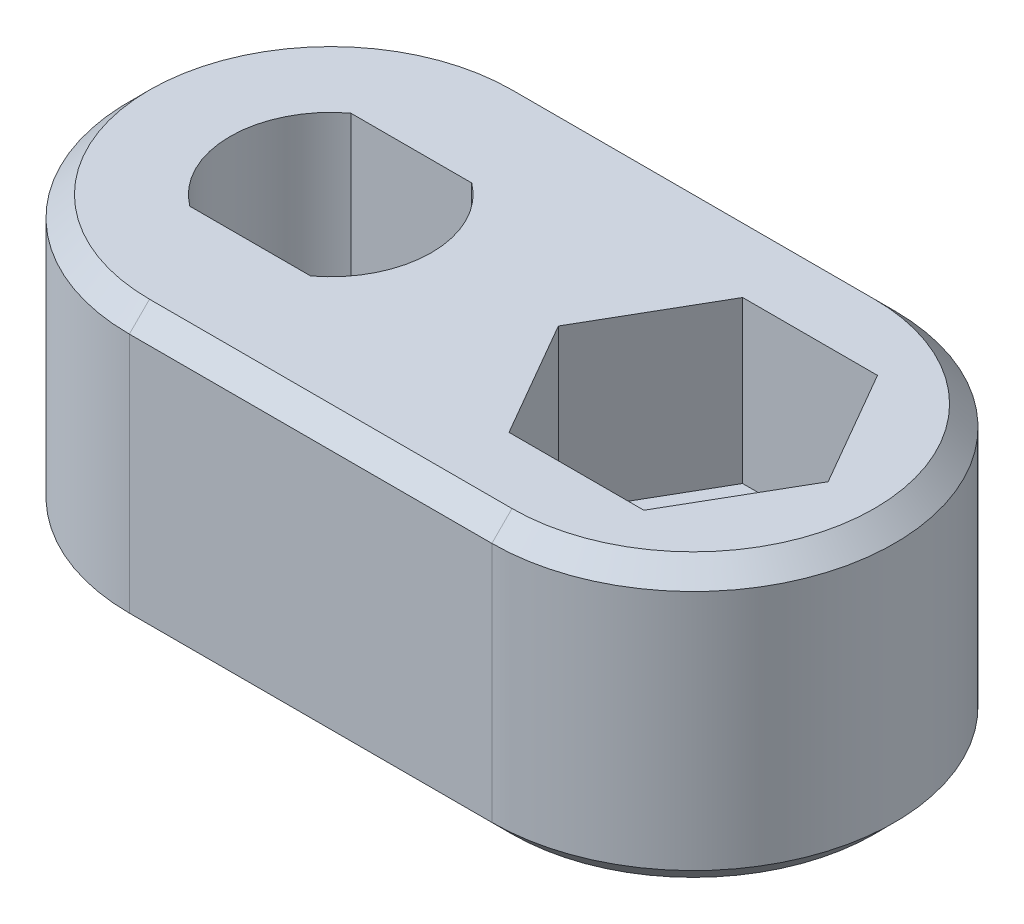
ISO-10303-21;
HEADER;
FILE_DESCRIPTION(('STEP AP214'),'2;1');
FILE_NAME('part.step','',(''),(''),'','','');
FILE_SCHEMA(('AUTOMOTIVE_DESIGN { 1 0 10303 214 1 1 1 1 }'));
ENDSEC;
DATA;
#1=APPLICATION_CONTEXT('core data for automotive mechanical design processes');
#2=APPLICATION_PROTOCOL_DEFINITION('international standard','automotive_design',2000,#1);
#3=PRODUCT_CONTEXT('',#1,'mechanical');
#4=PRODUCT('Part','Part','',(#3));
#5=PRODUCT_RELATED_PRODUCT_CATEGORY('part','',(#4));
#6=PRODUCT_DEFINITION_FORMATION('','',#4);
#7=PRODUCT_DEFINITION_CONTEXT('part definition',#1,'design');
#8=PRODUCT_DEFINITION('design','',#6,#7);
#9=PRODUCT_DEFINITION_SHAPE('','',#8);
#10=(LENGTH_UNIT() NAMED_UNIT(*) SI_UNIT(.MILLI.,.METRE.));
#11=(NAMED_UNIT(*) PLANE_ANGLE_UNIT() SI_UNIT($,.RADIAN.));
#12=(NAMED_UNIT(*) SI_UNIT($,.STERADIAN.) SOLID_ANGLE_UNIT());
#13=UNCERTAINTY_MEASURE_WITH_UNIT(LENGTH_MEASURE(1.E-05),#10,'distance_accuracy_value','');
#14=(GEOMETRIC_REPRESENTATION_CONTEXT(3) GLOBAL_UNCERTAINTY_ASSIGNED_CONTEXT((#13)) GLOBAL_UNIT_ASSIGNED_CONTEXT((#10,
#11,#12)) REPRESENTATION_CONTEXT('',''));
#15=CARTESIAN_POINT('',(0.,0.,0.));
#16=DIRECTION('',(0.,0.,1.));
#17=DIRECTION('',(1.,0.,0.));
#18=AXIS2_PLACEMENT_3D('',#15,#16,#17);
#19=CARTESIAN_POINT('',(9.,0.,0.));
#20=DIRECTION('',(0.,-1.,0.));
#21=DIRECTION('',(0.,0.,-1.));
#22=AXIS2_PLACEMENT_3D('',#19,#20,#21);
#23=CYLINDRICAL_SURFACE('',#22,2.07500000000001);
#24=CARTESIAN_POINT('',(9.,0.,0.));
#25=DIRECTION('',(0.,-1.,0.));
#26=DIRECTION('',(0.,0.,-1.));
#27=AXIS2_PLACEMENT_3D('',#24,#25,#26);
#28=CIRCLE('',#27,2.07500000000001);
#29=CARTESIAN_POINT('',(9.,0.,-2.07500000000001));
#30=VERTEX_POINT('',#29);
#31=EDGE_CURVE('E236',#30,#30,#28,.T.);
#32=ORIENTED_EDGE('',*,*,#31,.T.);
#33=EDGE_LOOP('',(#32));
#34=FACE_BOUND('',#33,.T.);
#35=CARTESIAN_POINT('',(9.,3.,0.));
#36=DIRECTION('',(0.,1.,0.));
#37=DIRECTION('',(0.,0.,1.));
#38=AXIS2_PLACEMENT_3D('',#35,#36,#37);
#39=CIRCLE('',#38,2.07500000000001);
#40=CARTESIAN_POINT('',(9.,3.,2.07500000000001));
#41=VERTEX_POINT('',#40);
#42=EDGE_CURVE('E228',#41,#41,#39,.F.);
#43=ORIENTED_EDGE('',*,*,#42,.F.);
#44=EDGE_LOOP('',(#43));
#45=FACE_BOUND('',#44,.T.);
#46=ADVANCED_FACE('F48',(#34,#45),#23,.F.);
#47=CARTESIAN_POINT('',(0.,7.,0.));
#48=DIRECTION('',(0.,-1.,0.));
#49=DIRECTION('',(0.,0.,-1.));
#50=AXIS2_PLACEMENT_3D('',#47,#48,#49);
#51=CYLINDRICAL_SURFACE('',#50,5.);
#52=DIRECTION('',(0.,-1.,0.));
#53=VECTOR('',#52,1.);
#54=CARTESIAN_POINT('',(0.,7.,5.));
#55=LINE('',#54,#53);
#56=CARTESIAN_POINT('',(0.,6.5,5.));
#57=VERTEX_POINT('',#56);
#58=CARTESIAN_POINT('',(0.,0.500000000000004,5.));
#59=VERTEX_POINT('',#58);
#60=EDGE_CURVE('E282',#57,#59,#55,.T.);
#61=ORIENTED_EDGE('',*,*,#60,.F.);
#62=CARTESIAN_POINT('',(0.,6.5,0.));
#63=DIRECTION('',(0.,1.,0.));
#64=DIRECTION('',(0.,0.,1.));
#65=AXIS2_PLACEMENT_3D('',#62,#63,#64);
#66=CIRCLE('',#65,5.);
#67=CARTESIAN_POINT('',(0.,6.5,-5.));
#68=VERTEX_POINT('',#67);
#69=EDGE_CURVE('E306',#57,#68,#66,.F.);
#70=ORIENTED_EDGE('',*,*,#69,.T.);
#71=DIRECTION('',(0.,-1.,0.));
#72=VECTOR('',#71,1.);
#73=CARTESIAN_POINT('',(0.,7.,-5.));
#74=LINE('',#73,#72);
#75=CARTESIAN_POINT('',(0.,0.500000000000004,-5.));
#76=VERTEX_POINT('',#75);
#77=EDGE_CURVE('E267',#68,#76,#74,.T.);
#78=ORIENTED_EDGE('',*,*,#77,.T.);
#79=CARTESIAN_POINT('',(0.,0.500000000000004,0.));
#80=DIRECTION('',(0.,1.,0.));
#81=DIRECTION('',(0.,0.,1.));
#82=AXIS2_PLACEMENT_3D('',#79,#80,#81);
#83=CIRCLE('',#82,5.);
#84=EDGE_CURVE('E304',#76,#59,#83,.T.);
#85=ORIENTED_EDGE('',*,*,#84,.T.);
#86=EDGE_LOOP('',(#61,#70,#78,#85));
#87=FACE_BOUND('',#86,.T.);
#88=ADVANCED_FACE('F357',(#87),#51,.T.);
#89=CARTESIAN_POINT('',(0.,7.,5.));
#90=DIRECTION('',(0.,0.,-1.));
#91=DIRECTION('',(-1.,0.,0.));
#92=AXIS2_PLACEMENT_3D('',#89,#90,#91);
#93=PLANE('',#92);
#94=DIRECTION('',(0.,-1.,0.));
#95=VECTOR('',#94,1.);
#96=CARTESIAN_POINT('',(9.,7.,5.));
#97=LINE('',#96,#95);
#98=CARTESIAN_POINT('',(9.,6.5,5.));
#99=VERTEX_POINT('',#98);
#100=CARTESIAN_POINT('',(9.,0.500000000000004,5.));
#101=VERTEX_POINT('',#100);
#102=EDGE_CURVE('E279',#99,#101,#97,.T.);
#103=ORIENTED_EDGE('',*,*,#102,.F.);
#104=DIRECTION('',(-1.,0.,0.));
#105=VECTOR('',#104,1.);
#106=CARTESIAN_POINT('',(0.,6.5,5.));
#107=LINE('',#106,#105);
#108=EDGE_CURVE('E314',#99,#57,#107,.T.);
#109=ORIENTED_EDGE('',*,*,#108,.T.);
#110=ORIENTED_EDGE('',*,*,#60,.T.);
#111=DIRECTION('',(1.,0.,0.));
#112=VECTOR('',#111,1.);
#113=CARTESIAN_POINT('',(0.,0.500000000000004,5.));
#114=LINE('',#113,#112);
#115=EDGE_CURVE('E312',#59,#101,#114,.T.);
#116=ORIENTED_EDGE('',*,*,#115,.T.);
#117=EDGE_LOOP('',(#103,#109,#110,#116));
#118=FACE_BOUND('',#117,.T.);
#119=ADVANCED_FACE('F374',(#118),#93,.F.);
#120=CARTESIAN_POINT('',(9.,7.,0.));
#121=DIRECTION('',(0.,-1.,0.));
#122=DIRECTION('',(0.,0.,-1.));
#123=AXIS2_PLACEMENT_3D('',#120,#121,#122);
#124=CYLINDRICAL_SURFACE('',#123,5.);
#125=DIRECTION('',(0.,-1.,0.));
#126=VECTOR('',#125,1.);
#127=CARTESIAN_POINT('',(9.,7.,-5.));
#128=LINE('',#127,#126);
#129=CARTESIAN_POINT('',(9.,6.5,-5.));
#130=VERTEX_POINT('',#129);
#131=CARTESIAN_POINT('',(9.,0.500000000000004,-5.));
#132=VERTEX_POINT('',#131);
#133=EDGE_CURVE('E276',#130,#132,#128,.T.);
#134=ORIENTED_EDGE('',*,*,#133,.F.);
#135=CARTESIAN_POINT('',(9.,6.5,0.));
#136=DIRECTION('',(0.,1.,0.));
#137=DIRECTION('',(0.,0.,1.));
#138=AXIS2_PLACEMENT_3D('',#135,#136,#137);
#139=CIRCLE('',#138,5.);
#140=EDGE_CURVE('E310',#130,#99,#139,.F.);
#141=ORIENTED_EDGE('',*,*,#140,.T.);
#142=ORIENTED_EDGE('',*,*,#102,.T.);
#143=CARTESIAN_POINT('',(9.,0.500000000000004,0.));
#144=DIRECTION('',(0.,1.,0.));
#145=DIRECTION('',(0.,0.,1.));
#146=AXIS2_PLACEMENT_3D('',#143,#144,#145);
#147=CIRCLE('',#146,5.);
#148=EDGE_CURVE('E308',#101,#132,#147,.T.);
#149=ORIENTED_EDGE('',*,*,#148,.T.);
#150=EDGE_LOOP('',(#134,#141,#142,#149));
#151=FACE_BOUND('',#150,.T.);
#152=ADVANCED_FACE('F370',(#151),#124,.T.);
#153=CARTESIAN_POINT('',(0.,7.,-5.));
#154=DIRECTION('',(0.,0.,1.));
#155=DIRECTION('',(1.,0.,0.));
#156=AXIS2_PLACEMENT_3D('',#153,#154,#155);
#157=PLANE('',#156);
#158=ORIENTED_EDGE('',*,*,#77,.F.);
#159=DIRECTION('',(1.,0.,0.));
#160=VECTOR('',#159,1.);
#161=CARTESIAN_POINT('',(9.,6.5,-5.));
#162=LINE('',#161,#160);
#163=EDGE_CURVE('E301',#68,#130,#162,.T.);
#164=ORIENTED_EDGE('',*,*,#163,.T.);
#165=ORIENTED_EDGE('',*,*,#133,.T.);
#166=DIRECTION('',(-1.,0.,0.));
#167=VECTOR('',#166,1.);
#168=CARTESIAN_POINT('',(0.,0.500000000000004,-5.));
#169=LINE('',#168,#167);
#170=EDGE_CURVE('E298',#132,#76,#169,.T.);
#171=ORIENTED_EDGE('',*,*,#170,.T.);
#172=EDGE_LOOP('',(#158,#164,#165,#171));
#173=FACE_BOUND('',#172,.T.);
#174=ADVANCED_FACE('F354',(#173),#157,.F.);
#175=CARTESIAN_POINT('',(0.,7.,0.));
#176=DIRECTION('',(0.,1.,0.));
#177=DIRECTION('',(0.,0.,1.));
#178=AXIS2_PLACEMENT_3D('',#175,#176,#177);
#179=PLANE('',#178);
#180=CARTESIAN_POINT('',(9.,7.,0.));
#181=DIRECTION('',(0.,1.,0.));
#182=DIRECTION('',(0.,0.,1.));
#183=AXIS2_PLACEMENT_3D('',#180,#181,#182);
#184=CIRCLE('',#183,4.5);
#185=CARTESIAN_POINT('',(9.,7.,4.5));
#186=VERTEX_POINT('',#185);
#187=CARTESIAN_POINT('',(9.,7.,-4.5));
#188=VERTEX_POINT('',#187);
#189=EDGE_CURVE('E291',#186,#188,#184,.T.);
#190=ORIENTED_EDGE('',*,*,#189,.T.);
#191=DIRECTION('',(-1.,0.,0.));
#192=VECTOR('',#191,1.);
#193=CARTESIAN_POINT('',(0.,7.,-4.5));
#194=LINE('',#193,#192);
#195=CARTESIAN_POINT('',(0.,7.,-4.5));
#196=VERTEX_POINT('',#195);
#197=EDGE_CURVE('E295',#188,#196,#194,.T.);
#198=ORIENTED_EDGE('',*,*,#197,.T.);
#199=CARTESIAN_POINT('',(0.,7.,0.));
#200=DIRECTION('',(0.,1.,0.));
#201=DIRECTION('',(0.,0.,1.));
#202=AXIS2_PLACEMENT_3D('',#199,#200,#201);
#203=CIRCLE('',#202,4.5);
#204=CARTESIAN_POINT('',(0.,7.,4.5));
#205=VERTEX_POINT('',#204);
#206=EDGE_CURVE('E293',#196,#205,#203,.T.);
#207=ORIENTED_EDGE('',*,*,#206,.T.);
#208=DIRECTION('',(1.,0.,0.));
#209=VECTOR('',#208,1.);
#210=CARTESIAN_POINT('',(9.,7.,4.5));
#211=LINE('',#210,#209);
#212=EDGE_CURVE('E285',#205,#186,#211,.T.);
#213=ORIENTED_EDGE('',*,*,#212,.T.);
#214=EDGE_LOOP('',(#190,#198,#207,#213));
#215=FACE_BOUND('',#214,.T.);
#216=DIRECTION('',(0.5,0.,-0.866025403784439));
#217=VECTOR('',#216,1.);
#218=CARTESIAN_POINT('',(10.6743157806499,7.,2.89999999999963));
#219=LINE('',#218,#217);
#220=CARTESIAN_POINT('',(10.6743157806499,7.,2.89999999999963));
#221=VERTEX_POINT('',#220);
#222=CARTESIAN_POINT('',(12.3486315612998,7.,-3.65159291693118E-13));
#223=VERTEX_POINT('',#222);
#224=EDGE_CURVE('E182',#221,#223,#219,.T.);
#225=ORIENTED_EDGE('',*,*,#224,.F.);
#226=DIRECTION('',(1.,0.,0.));
#227=VECTOR('',#226,1.);
#228=CARTESIAN_POINT('',(7.32568421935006,7.,2.89999999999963));
#229=LINE('',#228,#227);
#230=CARTESIAN_POINT('',(7.32568421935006,7.,2.89999999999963));
#231=VERTEX_POINT('',#230);
#232=EDGE_CURVE('E201',#231,#221,#229,.T.);
#233=ORIENTED_EDGE('',*,*,#232,.F.);
#234=DIRECTION('',(0.5,0.,0.866025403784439));
#235=VECTOR('',#234,1.);
#236=CARTESIAN_POINT('',(5.65136843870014,7.,-3.6457803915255E-13));
#237=LINE('',#236,#235);
#238=CARTESIAN_POINT('',(5.65136843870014,7.,-3.6457803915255E-13));
#239=VERTEX_POINT('',#238);
#240=EDGE_CURVE('E204',#239,#231,#237,.T.);
#241=ORIENTED_EDGE('',*,*,#240,.F.);
#242=DIRECTION('',(-0.5,0.,0.866025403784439));
#243=VECTOR('',#242,1.);
#244=CARTESIAN_POINT('',(7.32568421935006,7.,-2.90000000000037));
#245=LINE('',#244,#243);
#246=CARTESIAN_POINT('',(7.32568421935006,7.,-2.90000000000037));
#247=VERTEX_POINT('',#246);
#248=EDGE_CURVE('E221',#247,#239,#245,.T.);
#249=ORIENTED_EDGE('',*,*,#248,.F.);
#250=DIRECTION('',(-1.,0.,0.));
#251=VECTOR('',#250,1.);
#252=CARTESIAN_POINT('',(10.6743157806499,7.,-2.90000000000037));
#253=LINE('',#252,#251);
#254=CARTESIAN_POINT('',(10.6743157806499,7.,-2.90000000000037));
#255=VERTEX_POINT('',#254);
#256=EDGE_CURVE('E218',#255,#247,#253,.T.);
#257=ORIENTED_EDGE('',*,*,#256,.F.);
#258=DIRECTION('',(-0.5,0.,-0.866025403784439));
#259=VECTOR('',#258,1.);
#260=CARTESIAN_POINT('',(12.3486315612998,7.,-3.65159291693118E-13));
#261=LINE('',#260,#259);
#262=EDGE_CURVE('E215',#223,#255,#261,.T.);
#263=ORIENTED_EDGE('',*,*,#262,.F.);
#264=EDGE_LOOP('',(#225,#233,#241,#249,#257,#263));
#265=FACE_BOUND('',#264,.T.);
#266=CARTESIAN_POINT('',(0.,7.,0.));
#267=DIRECTION('',(0.,1.,0.));
#268=DIRECTION('',(0.,0.,1.));
#269=AXIS2_PLACEMENT_3D('',#266,#267,#268);
#270=CIRCLE('',#269,2.5);
#271=CARTESIAN_POINT('',(1.5,7.,2.));
#272=VERTEX_POINT('',#271);
#273=CARTESIAN_POINT('',(1.5,7.,-2.));
#274=VERTEX_POINT('',#273);
#275=EDGE_CURVE('E257',#272,#274,#270,.T.);
#276=ORIENTED_EDGE('',*,*,#275,.F.);
#277=DIRECTION('',(1.,0.,0.));
#278=VECTOR('',#277,1.);
#279=CARTESIAN_POINT('',(0.,7.,2.));
#280=LINE('',#279,#278);
#281=CARTESIAN_POINT('',(-1.5,7.,2.));
#282=VERTEX_POINT('',#281);
#283=EDGE_CURVE('E250',#282,#272,#280,.T.);
#284=ORIENTED_EDGE('',*,*,#283,.F.);
#285=CARTESIAN_POINT('',(-1.5,7.,-2.));
#286=VERTEX_POINT('',#285);
#287=EDGE_CURVE('E260',#286,#282,#270,.T.);
#288=ORIENTED_EDGE('',*,*,#287,.F.);
#289=DIRECTION('',(1.,0.,0.));
#290=VECTOR('',#289,1.);
#291=CARTESIAN_POINT('',(0.,7.,-2.));
#292=LINE('',#291,#290);
#293=EDGE_CURVE('E259',#286,#274,#292,.T.);
#294=ORIENTED_EDGE('',*,*,#293,.T.);
#295=EDGE_LOOP('',(#276,#284,#288,#294));
#296=FACE_BOUND('',#295,.T.);
#297=ADVANCED_FACE('F383',(#215,#265,#296),#179,.T.);
#298=CARTESIAN_POINT('',(0.,0.,0.));
#299=DIRECTION('',(0.,1.,0.));
#300=DIRECTION('',(0.,0.,1.));
#301=AXIS2_PLACEMENT_3D('',#298,#299,#300);
#302=PLANE('',#301);
#303=CARTESIAN_POINT('',(0.,0.,0.));
#304=DIRECTION('',(0.,1.,0.));
#305=DIRECTION('',(0.,0.,1.));
#306=AXIS2_PLACEMENT_3D('',#303,#304,#305);
#307=CIRCLE('',#306,4.5);
#308=CARTESIAN_POINT('',(0.,0.,4.5));
#309=VERTEX_POINT('',#308);
#310=CARTESIAN_POINT('',(0.,0.,-4.5));
#311=VERTEX_POINT('',#310);
#312=EDGE_CURVE('E57',#309,#311,#307,.F.);
#313=ORIENTED_EDGE('',*,*,#312,.T.);
#314=DIRECTION('',(1.,0.,0.));
#315=VECTOR('',#314,1.);
#316=CARTESIAN_POINT('',(0.,0.,-4.5));
#317=LINE('',#316,#315);
#318=CARTESIAN_POINT('',(9.,0.,-4.5));
#319=VERTEX_POINT('',#318);
#320=EDGE_CURVE('E13',#311,#319,#317,.T.);
#321=ORIENTED_EDGE('',*,*,#320,.T.);
#322=CARTESIAN_POINT('',(9.,0.,0.));
#323=DIRECTION('',(0.,1.,0.));
#324=DIRECTION('',(0.,0.,1.));
#325=AXIS2_PLACEMENT_3D('',#322,#323,#324);
#326=CIRCLE('',#325,4.5);
#327=CARTESIAN_POINT('',(9.,0.,4.5));
#328=VERTEX_POINT('',#327);
#329=EDGE_CURVE('E318',#319,#328,#326,.F.);
#330=ORIENTED_EDGE('',*,*,#329,.T.);
#331=DIRECTION('',(-1.,0.,0.));
#332=VECTOR('',#331,1.);
#333=CARTESIAN_POINT('',(0.,0.,4.5));
#334=LINE('',#333,#332);
#335=EDGE_CURVE('E316',#328,#309,#334,.T.);
#336=ORIENTED_EDGE('',*,*,#335,.T.);
#337=EDGE_LOOP('',(#313,#321,#330,#336));
#338=FACE_BOUND('',#337,.T.);
#339=ORIENTED_EDGE('',*,*,#31,.F.);
#340=EDGE_LOOP('',(#339));
#341=FACE_BOUND('',#340,.T.);
#342=CARTESIAN_POINT('',(0.,0.,0.));
#343=DIRECTION('',(0.,-1.,0.));
#344=DIRECTION('',(0.,0.,-1.));
#345=AXIS2_PLACEMENT_3D('',#342,#343,#344);
#346=CIRCLE('',#345,3.36);
#347=CARTESIAN_POINT('',(0.,0.,-3.36));
#348=VERTEX_POINT('',#347);
#349=EDGE_CURVE('E239',#348,#348,#346,.T.);
#350=ORIENTED_EDGE('',*,*,#349,.F.);
#351=EDGE_LOOP('',(#350));
#352=FACE_BOUND('',#351,.T.);
#353=ADVANCED_FACE('F345',(#338,#341,#352),#302,.F.);
#354=CARTESIAN_POINT('',(0.,3.,0.));
#355=DIRECTION('',(0.,1.,0.));
#356=DIRECTION('',(0.,0.,1.));
#357=AXIS2_PLACEMENT_3D('',#354,#355,#356);
#358=CYLINDRICAL_SURFACE('',#357,2.5);
#359=ORIENTED_EDGE('',*,*,#275,.T.);
#360=DIRECTION('',(0.,1.,0.));
#361=VECTOR('',#360,1.);
#362=CARTESIAN_POINT('',(1.5,3.,-2.));
#363=LINE('',#362,#361);
#364=CARTESIAN_POINT('',(1.5,3.,-2.));
#365=VERTEX_POINT('',#364);
#366=EDGE_CURVE('E256',#365,#274,#363,.T.);
#367=ORIENTED_EDGE('',*,*,#366,.F.);
#368=CARTESIAN_POINT('',(0.,3.,0.));
#369=DIRECTION('',(0.,1.,0.));
#370=DIRECTION('',(0.,0.,1.));
#371=AXIS2_PLACEMENT_3D('',#368,#369,#370);
#372=CIRCLE('',#371,2.5);
#373=CARTESIAN_POINT('',(1.5,3.,2.));
#374=VERTEX_POINT('',#373);
#375=EDGE_CURVE('E246',#374,#365,#372,.T.);
#376=ORIENTED_EDGE('',*,*,#375,.F.);
#377=DIRECTION('',(0.,1.,0.));
#378=VECTOR('',#377,1.);
#379=CARTESIAN_POINT('',(1.5,3.,2.));
#380=LINE('',#379,#378);
#381=EDGE_CURVE('E265',#374,#272,#380,.T.);
#382=ORIENTED_EDGE('',*,*,#381,.T.);
#383=EDGE_LOOP('',(#359,#367,#376,#382));
#384=FACE_BOUND('',#383,.T.);
#385=ADVANCED_FACE('F395',(#384),#358,.F.);
#386=CARTESIAN_POINT('',(0.,3.,2.));
#387=DIRECTION('',(0.,0.,1.));
#388=DIRECTION('',(1.,0.,0.));
#389=AXIS2_PLACEMENT_3D('',#386,#387,#388);
#390=PLANE('',#389);
#391=ORIENTED_EDGE('',*,*,#283,.T.);
#392=ORIENTED_EDGE('',*,*,#381,.F.);
#393=DIRECTION('',(1.,0.,0.));
#394=VECTOR('',#393,1.);
#395=CARTESIAN_POINT('',(0.,3.,2.));
#396=LINE('',#395,#394);
#397=CARTESIAN_POINT('',(-1.5,3.,2.));
#398=VERTEX_POINT('',#397);
#399=EDGE_CURVE('E253',#398,#374,#396,.T.);
#400=ORIENTED_EDGE('',*,*,#399,.F.);
#401=DIRECTION('',(0.,1.,0.));
#402=VECTOR('',#401,1.);
#403=CARTESIAN_POINT('',(-1.5,3.,2.));
#404=LINE('',#403,#402);
#405=EDGE_CURVE('E268',#398,#282,#404,.T.);
#406=ORIENTED_EDGE('',*,*,#405,.T.);
#407=EDGE_LOOP('',(#391,#392,#400,#406));
#408=FACE_BOUND('',#407,.T.);
#409=ADVANCED_FACE('F409',(#408),#390,.F.);
#410=ORIENTED_EDGE('',*,*,#287,.T.);
#411=ORIENTED_EDGE('',*,*,#405,.F.);
#412=CARTESIAN_POINT('',(-1.5,3.,-2.));
#413=VERTEX_POINT('',#412);
#414=EDGE_CURVE('E251',#413,#398,#372,.T.);
#415=ORIENTED_EDGE('',*,*,#414,.F.);
#416=DIRECTION('',(0.,1.,0.));
#417=VECTOR('',#416,1.);
#418=CARTESIAN_POINT('',(-1.5,3.,-2.));
#419=LINE('',#418,#417);
#420=EDGE_CURVE('E270',#413,#286,#419,.T.);
#421=ORIENTED_EDGE('',*,*,#420,.T.);
#422=EDGE_LOOP('',(#410,#411,#415,#421));
#423=FACE_BOUND('',#422,.T.);
#424=ADVANCED_FACE('F407',(#423),#358,.F.);
#425=CARTESIAN_POINT('',(0.,3.,-2.));
#426=DIRECTION('',(0.,0.,1.));
#427=DIRECTION('',(1.,0.,0.));
#428=AXIS2_PLACEMENT_3D('',#425,#426,#427);
#429=PLANE('',#428);
#430=ORIENTED_EDGE('',*,*,#293,.F.);
#431=ORIENTED_EDGE('',*,*,#420,.F.);
#432=DIRECTION('',(1.,0.,0.));
#433=VECTOR('',#432,1.);
#434=CARTESIAN_POINT('',(0.,3.,-2.));
#435=LINE('',#434,#433);
#436=EDGE_CURVE('E249',#413,#365,#435,.T.);
#437=ORIENTED_EDGE('',*,*,#436,.T.);
#438=ORIENTED_EDGE('',*,*,#366,.T.);
#439=EDGE_LOOP('',(#430,#431,#437,#438));
#440=FACE_BOUND('',#439,.T.);
#441=ADVANCED_FACE('F398',(#440),#429,.T.);
#442=CARTESIAN_POINT('',(0.,3.,0.));
#443=DIRECTION('',(0.,1.,0.));
#444=DIRECTION('',(0.,0.,1.));
#445=AXIS2_PLACEMENT_3D('',#442,#443,#444);
#446=PLANE('',#445);
#447=CARTESIAN_POINT('',(0.,3.,0.));
#448=DIRECTION('',(0.,1.,0.));
#449=DIRECTION('',(0.,0.,1.));
#450=AXIS2_PLACEMENT_3D('',#447,#448,#449);
#451=CIRCLE('',#450,1.7);
#452=CARTESIAN_POINT('',(0.,3.,1.7));
#453=VERTEX_POINT('',#452);
#454=EDGE_CURVE('E245',#453,#453,#451,.T.);
#455=ORIENTED_EDGE('',*,*,#454,.F.);
#456=EDGE_LOOP('',(#455));
#457=FACE_BOUND('',#456,.T.);
#458=ORIENTED_EDGE('',*,*,#375,.T.);
#459=ORIENTED_EDGE('',*,*,#436,.F.);
#460=ORIENTED_EDGE('',*,*,#414,.T.);
#461=ORIENTED_EDGE('',*,*,#399,.T.);
#462=EDGE_LOOP('',(#458,#459,#460,#461));
#463=FACE_BOUND('',#462,.T.);
#464=ADVANCED_FACE('F403',(#457,#463),#446,.T.);
#465=CARTESIAN_POINT('',(0.,0.,0.));
#466=DIRECTION('',(0.,-1.,0.));
#467=DIRECTION('',(0.,0.,-1.));
#468=AXIS2_PLACEMENT_3D('',#465,#466,#467);
#469=CYLINDRICAL_SURFACE('',#468,1.7);
#470=ORIENTED_EDGE('',*,*,#454,.T.);
#471=EDGE_LOOP('',(#470));
#472=FACE_BOUND('',#471,.T.);
#473=CARTESIAN_POINT('',(0.,1.66,0.));
#474=DIRECTION('',(0.,-1.,0.));
#475=DIRECTION('',(0.,0.,-1.));
#476=AXIS2_PLACEMENT_3D('',#473,#474,#475);
#477=CIRCLE('',#476,1.7);
#478=CARTESIAN_POINT('',(0.,1.66,-1.7));
#479=VERTEX_POINT('',#478);
#480=EDGE_CURVE('E242',#479,#479,#477,.T.);
#481=ORIENTED_EDGE('',*,*,#480,.T.);
#482=EDGE_LOOP('',(#481));
#483=FACE_BOUND('',#482,.T.);
#484=ADVANCED_FACE('F432',(#472,#483),#469,.F.);
#485=CARTESIAN_POINT('',(0.,0.,0.));
#486=DIRECTION('',(0.,-1.,0.));
#487=DIRECTION('',(0.,0.,-1.));
#488=AXIS2_PLACEMENT_3D('',#485,#486,#487);
#489=CONICAL_SURFACE('',#488,3.36,0.785398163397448);
#490=ORIENTED_EDGE('',*,*,#480,.F.);
#491=EDGE_LOOP('',(#490));
#492=FACE_BOUND('',#491,.T.);
#493=ORIENTED_EDGE('',*,*,#349,.T.);
#494=EDGE_LOOP('',(#493));
#495=FACE_BOUND('',#494,.T.);
#496=ADVANCED_FACE('F429',(#492,#495),#489,.F.);
#497=CARTESIAN_POINT('',(0.,3.,0.));
#498=DIRECTION('',(0.,1.,0.));
#499=DIRECTION('',(0.,0.,1.));
#500=AXIS2_PLACEMENT_3D('',#497,#498,#499);
#501=PLANE('',#500);
#502=DIRECTION('',(0.5,0.,-0.866025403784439));
#503=VECTOR('',#502,1.);
#504=CARTESIAN_POINT('',(10.6743157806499,3.,2.89999999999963));
#505=LINE('',#504,#503);
#506=CARTESIAN_POINT('',(10.6743157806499,3.,2.89999999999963));
#507=VERTEX_POINT('',#506);
#508=CARTESIAN_POINT('',(12.3486315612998,3.,-3.65159291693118E-13));
#509=VERTEX_POINT('',#508);
#510=EDGE_CURVE('E179',#507,#509,#505,.T.);
#511=ORIENTED_EDGE('',*,*,#510,.T.);
#512=DIRECTION('',(-0.5,0.,-0.866025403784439));
#513=VECTOR('',#512,1.);
#514=CARTESIAN_POINT('',(12.3486315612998,3.,-3.65159291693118E-13));
#515=LINE('',#514,#513);
#516=CARTESIAN_POINT('',(10.6743157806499,3.,-2.90000000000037));
#517=VERTEX_POINT('',#516);
#518=EDGE_CURVE('E190',#509,#517,#515,.T.);
#519=ORIENTED_EDGE('',*,*,#518,.T.);
#520=DIRECTION('',(-1.,0.,0.));
#521=VECTOR('',#520,1.);
#522=CARTESIAN_POINT('',(10.6743157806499,3.,-2.90000000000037));
#523=LINE('',#522,#521);
#524=CARTESIAN_POINT('',(7.32568421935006,3.,-2.90000000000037));
#525=VERTEX_POINT('',#524);
#526=EDGE_CURVE('E195',#517,#525,#523,.T.);
#527=ORIENTED_EDGE('',*,*,#526,.T.);
#528=DIRECTION('',(-0.5,0.,0.866025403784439));
#529=VECTOR('',#528,1.);
#530=CARTESIAN_POINT('',(7.32568421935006,3.,-2.90000000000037));
#531=LINE('',#530,#529);
#532=CARTESIAN_POINT('',(5.65136843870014,3.,-3.6457803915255E-13));
#533=VERTEX_POINT('',#532);
#534=EDGE_CURVE('E208',#525,#533,#531,.T.);
#535=ORIENTED_EDGE('',*,*,#534,.T.);
#536=DIRECTION('',(0.5,0.,0.866025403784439));
#537=VECTOR('',#536,1.);
#538=CARTESIAN_POINT('',(5.65136843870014,3.,-3.6457803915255E-13));
#539=LINE('',#538,#537);
#540=CARTESIAN_POINT('',(7.32568421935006,3.,2.89999999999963));
#541=VERTEX_POINT('',#540);
#542=EDGE_CURVE('E211',#533,#541,#539,.T.);
#543=ORIENTED_EDGE('',*,*,#542,.T.);
#544=DIRECTION('',(1.,0.,0.));
#545=VECTOR('',#544,1.);
#546=CARTESIAN_POINT('',(7.32568421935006,3.,2.89999999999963));
#547=LINE('',#546,#545);
#548=EDGE_CURVE('E187',#541,#507,#547,.T.);
#549=ORIENTED_EDGE('',*,*,#548,.T.);
#550=EDGE_LOOP('',(#511,#519,#527,#535,#543,#549));
#551=FACE_BOUND('',#550,.T.);
#552=ORIENTED_EDGE('',*,*,#42,.T.);
#553=EDGE_LOOP('',(#552));
#554=FACE_BOUND('',#553,.T.);
#555=ADVANCED_FACE('F197',(#551,#554),#501,.T.);
#556=CARTESIAN_POINT('',(10.6743157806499,3.,2.89999999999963));
#557=DIRECTION('',(0.866025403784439,0.,0.5));
#558=DIRECTION('',(0.5,0.,-0.866025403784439));
#559=AXIS2_PLACEMENT_3D('',#556,#557,#558);
#560=PLANE('',#559);
#561=ORIENTED_EDGE('',*,*,#224,.T.);
#562=DIRECTION('',(0.,1.,0.));
#563=VECTOR('',#562,1.);
#564=CARTESIAN_POINT('',(12.3486315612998,3.,-3.65159291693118E-13));
#565=LINE('',#564,#563);
#566=EDGE_CURVE('E175',#509,#223,#565,.T.);
#567=ORIENTED_EDGE('',*,*,#566,.F.);
#568=ORIENTED_EDGE('',*,*,#510,.F.);
#569=DIRECTION('',(0.,1.,0.));
#570=VECTOR('',#569,1.);
#571=CARTESIAN_POINT('',(10.6743157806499,3.,2.89999999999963));
#572=LINE('',#571,#570);
#573=EDGE_CURVE('E226',#507,#221,#572,.T.);
#574=ORIENTED_EDGE('',*,*,#573,.T.);
#575=EDGE_LOOP('',(#561,#567,#568,#574));
#576=FACE_BOUND('',#575,.T.);
#577=ADVANCED_FACE('F177',(#576),#560,.F.);
#578=CARTESIAN_POINT('',(7.32568421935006,3.,2.89999999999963));
#579=DIRECTION('',(0.,0.,1.));
#580=DIRECTION('',(1.,0.,0.));
#581=AXIS2_PLACEMENT_3D('',#578,#579,#580);
#582=PLANE('',#581);
#583=ORIENTED_EDGE('',*,*,#232,.T.);
#584=ORIENTED_EDGE('',*,*,#573,.F.);
#585=ORIENTED_EDGE('',*,*,#548,.F.);
#586=DIRECTION('',(0.,1.,0.));
#587=VECTOR('',#586,1.);
#588=CARTESIAN_POINT('',(7.32568421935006,3.,2.89999999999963));
#589=LINE('',#588,#587);
#590=EDGE_CURVE('E229',#541,#231,#589,.T.);
#591=ORIENTED_EDGE('',*,*,#590,.T.);
#592=EDGE_LOOP('',(#583,#584,#585,#591));
#593=FACE_BOUND('',#592,.T.);
#594=ADVANCED_FACE('F521',(#593),#582,.F.);
#595=CARTESIAN_POINT('',(5.65136843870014,3.,-3.6457803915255E-13));
#596=DIRECTION('',(-0.866025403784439,0.,0.5));
#597=DIRECTION('',(0.5,0.,0.866025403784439));
#598=AXIS2_PLACEMENT_3D('',#595,#596,#597);
#599=PLANE('',#598);
#600=ORIENTED_EDGE('',*,*,#240,.T.);
#601=ORIENTED_EDGE('',*,*,#590,.F.);
#602=ORIENTED_EDGE('',*,*,#542,.F.);
#603=DIRECTION('',(0.,1.,0.));
#604=VECTOR('',#603,1.);
#605=CARTESIAN_POINT('',(5.65136843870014,3.,-3.6457803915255E-13));
#606=LINE('',#605,#604);
#607=EDGE_CURVE('E231',#533,#239,#606,.T.);
#608=ORIENTED_EDGE('',*,*,#607,.T.);
#609=EDGE_LOOP('',(#600,#601,#602,#608));
#610=FACE_BOUND('',#609,.T.);
#611=ADVANCED_FACE('F513',(#610),#599,.F.);
#612=CARTESIAN_POINT('',(7.32568421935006,3.,-2.90000000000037));
#613=DIRECTION('',(-0.866025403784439,0.,-0.5));
#614=DIRECTION('',(-0.5,0.,0.866025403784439));
#615=AXIS2_PLACEMENT_3D('',#612,#613,#614);
#616=PLANE('',#615);
#617=ORIENTED_EDGE('',*,*,#248,.T.);
#618=ORIENTED_EDGE('',*,*,#607,.F.);
#619=ORIENTED_EDGE('',*,*,#534,.F.);
#620=DIRECTION('',(0.,1.,0.));
#621=VECTOR('',#620,1.);
#622=CARTESIAN_POINT('',(7.32568421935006,3.,-2.90000000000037));
#623=LINE('',#622,#621);
#624=EDGE_CURVE('E233',#525,#247,#623,.T.);
#625=ORIENTED_EDGE('',*,*,#624,.T.);
#626=EDGE_LOOP('',(#617,#618,#619,#625));
#627=FACE_BOUND('',#626,.T.);
#628=ADVANCED_FACE('F505',(#627),#616,.F.);
#629=CARTESIAN_POINT('',(10.6743157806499,3.,-2.90000000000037));
#630=DIRECTION('',(0.,0.,-1.));
#631=DIRECTION('',(-1.,0.,0.));
#632=AXIS2_PLACEMENT_3D('',#629,#630,#631);
#633=PLANE('',#632);
#634=ORIENTED_EDGE('',*,*,#256,.T.);
#635=ORIENTED_EDGE('',*,*,#624,.F.);
#636=ORIENTED_EDGE('',*,*,#526,.F.);
#637=DIRECTION('',(0.,1.,0.));
#638=VECTOR('',#637,1.);
#639=CARTESIAN_POINT('',(10.6743157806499,3.,-2.90000000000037));
#640=LINE('',#639,#638);
#641=EDGE_CURVE('E186',#517,#255,#640,.T.);
#642=ORIENTED_EDGE('',*,*,#641,.T.);
#643=EDGE_LOOP('',(#634,#635,#636,#642));
#644=FACE_BOUND('',#643,.T.);
#645=ADVANCED_FACE('F498',(#644),#633,.F.);
#646=CARTESIAN_POINT('',(12.3486315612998,3.,-3.65159291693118E-13));
#647=DIRECTION('',(0.866025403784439,0.,-0.5));
#648=DIRECTION('',(-0.5,0.,-0.866025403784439));
#649=AXIS2_PLACEMENT_3D('',#646,#647,#648);
#650=PLANE('',#649);
#651=ORIENTED_EDGE('',*,*,#262,.T.);
#652=ORIENTED_EDGE('',*,*,#641,.F.);
#653=ORIENTED_EDGE('',*,*,#518,.F.);
#654=ORIENTED_EDGE('',*,*,#566,.T.);
#655=EDGE_LOOP('',(#651,#652,#653,#654));
#656=FACE_BOUND('',#655,.T.);
#657=ADVANCED_FACE('F191',(#656),#650,.F.);
#658=CARTESIAN_POINT('',(0.,7.,4.5));
#659=DIRECTION('',(0.,0.707106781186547,0.707106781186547));
#660=DIRECTION('',(-1.,0.,0.));
#661=AXIS2_PLACEMENT_3D('',#658,#659,#660);
#662=PLANE('',#661);
#663=DIRECTION('',(0.,0.707106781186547,-0.707106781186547));
#664=VECTOR('',#663,1.);
#665=CARTESIAN_POINT('',(0.,6.5,5.));
#666=LINE('',#665,#664);
#667=EDGE_CURVE('E325',#57,#205,#666,.T.);
#668=ORIENTED_EDGE('',*,*,#667,.F.);
#669=ORIENTED_EDGE('',*,*,#108,.F.);
#670=DIRECTION('',(0.,-0.707106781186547,0.707106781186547));
#671=VECTOR('',#670,1.);
#672=CARTESIAN_POINT('',(9.,7.,4.5));
#673=LINE('',#672,#671);
#674=EDGE_CURVE('E216',#186,#99,#673,.T.);
#675=ORIENTED_EDGE('',*,*,#674,.F.);
#676=ORIENTED_EDGE('',*,*,#212,.F.);
#677=EDGE_LOOP('',(#668,#669,#675,#676));
#678=FACE_BOUND('',#677,.T.);
#679=ADVANCED_FACE('F377',(#678),#662,.T.);
#680=CARTESIAN_POINT('',(9.,7.,0.));
#681=DIRECTION('',(0.,-1.,0.));
#682=DIRECTION('',(0.,0.,-1.));
#683=AXIS2_PLACEMENT_3D('',#680,#681,#682);
#684=CONICAL_SURFACE('',#683,4.5,0.785398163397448);
#685=ORIENTED_EDGE('',*,*,#674,.T.);
#686=ORIENTED_EDGE('',*,*,#140,.F.);
#687=DIRECTION('',(0.,-0.707106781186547,-0.707106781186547));
#688=VECTOR('',#687,1.);
#689=CARTESIAN_POINT('',(9.,7.,-4.5));
#690=LINE('',#689,#688);
#691=EDGE_CURVE('E323',#188,#130,#690,.T.);
#692=ORIENTED_EDGE('',*,*,#691,.F.);
#693=ORIENTED_EDGE('',*,*,#189,.F.);
#694=EDGE_LOOP('',(#685,#686,#692,#693));
#695=FACE_BOUND('',#694,.T.);
#696=ADVANCED_FACE('F381',(#695),#684,.T.);
#697=CARTESIAN_POINT('',(0.,7.,0.));
#698=DIRECTION('',(0.,-1.,0.));
#699=DIRECTION('',(0.,0.,-1.));
#700=AXIS2_PLACEMENT_3D('',#697,#698,#699);
#701=CONICAL_SURFACE('',#700,4.5,0.785398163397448);
#702=ORIENTED_EDGE('',*,*,#667,.T.);
#703=ORIENTED_EDGE('',*,*,#206,.F.);
#704=DIRECTION('',(0.,0.707106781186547,0.707106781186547));
#705=VECTOR('',#704,1.);
#706=CARTESIAN_POINT('',(0.,6.5,-5.));
#707=LINE('',#706,#705);
#708=EDGE_CURVE('E321',#68,#196,#707,.T.);
#709=ORIENTED_EDGE('',*,*,#708,.F.);
#710=ORIENTED_EDGE('',*,*,#69,.F.);
#711=EDGE_LOOP('',(#702,#703,#709,#710));
#712=FACE_BOUND('',#711,.T.);
#713=ADVANCED_FACE('F362',(#712),#701,.T.);
#714=CARTESIAN_POINT('',(0.,7.,-4.5));
#715=DIRECTION('',(0.,0.707106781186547,-0.707106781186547));
#716=DIRECTION('',(1.,0.,0.));
#717=AXIS2_PLACEMENT_3D('',#714,#715,#716);
#718=PLANE('',#717);
#719=ORIENTED_EDGE('',*,*,#691,.T.);
#720=ORIENTED_EDGE('',*,*,#163,.F.);
#721=ORIENTED_EDGE('',*,*,#708,.T.);
#722=ORIENTED_EDGE('',*,*,#197,.F.);
#723=EDGE_LOOP('',(#719,#720,#721,#722));
#724=FACE_BOUND('',#723,.T.);
#725=ADVANCED_FACE('F366',(#724),#718,.T.);
#726=CARTESIAN_POINT('',(0.,0.500000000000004,5.));
#727=DIRECTION('',(0.,0.707106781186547,-0.707106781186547));
#728=DIRECTION('',(1.,0.,0.));
#729=AXIS2_PLACEMENT_3D('',#726,#727,#728);
#730=PLANE('',#729);
#731=DIRECTION('',(0.,0.707106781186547,0.707106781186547));
#732=VECTOR('',#731,1.);
#733=CARTESIAN_POINT('',(0.,0.,4.5));
#734=LINE('',#733,#732);
#735=EDGE_CURVE('E332',#309,#59,#734,.T.);
#736=ORIENTED_EDGE('',*,*,#735,.F.);
#737=ORIENTED_EDGE('',*,*,#335,.F.);
#738=DIRECTION('',(0.,-0.707106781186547,-0.707106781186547));
#739=VECTOR('',#738,1.);
#740=CARTESIAN_POINT('',(9.,0.500000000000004,5.));
#741=LINE('',#740,#739);
#742=EDGE_CURVE('E52',#101,#328,#741,.T.);
#743=ORIENTED_EDGE('',*,*,#742,.F.);
#744=ORIENTED_EDGE('',*,*,#115,.F.);
#745=EDGE_LOOP('',(#736,#737,#743,#744));
#746=FACE_BOUND('',#745,.T.);
#747=ADVANCED_FACE('F50',(#746),#730,.F.);
#748=CARTESIAN_POINT('',(9.,0.500000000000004,0.));
#749=DIRECTION('',(0.,1.,0.));
#750=DIRECTION('',(0.,0.,1.));
#751=AXIS2_PLACEMENT_3D('',#748,#749,#750);
#752=CONICAL_SURFACE('',#751,5.,0.785398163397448);
#753=ORIENTED_EDGE('',*,*,#742,.T.);
#754=ORIENTED_EDGE('',*,*,#329,.F.);
#755=DIRECTION('',(0.,-0.707106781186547,0.707106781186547));
#756=VECTOR('',#755,1.);
#757=CARTESIAN_POINT('',(9.,0.500000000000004,-5.));
#758=LINE('',#757,#756);
#759=EDGE_CURVE('E70',#132,#319,#758,.T.);
#760=ORIENTED_EDGE('',*,*,#759,.F.);
#761=ORIENTED_EDGE('',*,*,#148,.F.);
#762=EDGE_LOOP('',(#753,#754,#760,#761));
#763=FACE_BOUND('',#762,.T.);
#764=ADVANCED_FACE('F341',(#763),#752,.T.);
#765=CARTESIAN_POINT('',(0.,0.500000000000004,0.));
#766=DIRECTION('',(0.,1.,0.));
#767=DIRECTION('',(0.,0.,1.));
#768=AXIS2_PLACEMENT_3D('',#765,#766,#767);
#769=CONICAL_SURFACE('',#768,5.,0.785398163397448);
#770=ORIENTED_EDGE('',*,*,#735,.T.);
#771=ORIENTED_EDGE('',*,*,#84,.F.);
#772=DIRECTION('',(0.,0.707106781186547,-0.707106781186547));
#773=VECTOR('',#772,1.);
#774=CARTESIAN_POINT('',(0.,0.,-4.5));
#775=LINE('',#774,#773);
#776=EDGE_CURVE('E330',#311,#76,#775,.T.);
#777=ORIENTED_EDGE('',*,*,#776,.F.);
#778=ORIENTED_EDGE('',*,*,#312,.F.);
#779=EDGE_LOOP('',(#770,#771,#777,#778));
#780=FACE_BOUND('',#779,.T.);
#781=ADVANCED_FACE('F349',(#780),#769,.T.);
#782=CARTESIAN_POINT('',(0.,0.500000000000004,-5.));
#783=DIRECTION('',(0.,0.707106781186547,0.707106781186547));
#784=DIRECTION('',(-1.,0.,0.));
#785=AXIS2_PLACEMENT_3D('',#782,#783,#784);
#786=PLANE('',#785);
#787=ORIENTED_EDGE('',*,*,#759,.T.);
#788=ORIENTED_EDGE('',*,*,#320,.F.);
#789=ORIENTED_EDGE('',*,*,#776,.T.);
#790=ORIENTED_EDGE('',*,*,#170,.F.);
#791=EDGE_LOOP('',(#787,#788,#789,#790));
#792=FACE_BOUND('',#791,.T.);
#793=ADVANCED_FACE('F348',(#792),#786,.F.);
#794=CLOSED_SHELL('',(#46,#88,#119,#152,#174,#297,#353,#385,#409,#424,#441,#464,#484,#496,#555,
#577,#594,#611,#628,#645,#657,#679,#696,#713,#725,#747,#764,#781,#793));
#795=MANIFOLD_SOLID_BREP('B2',#794);
#796=ADVANCED_BREP_SHAPE_REPRESENTATION('',(#18,#795),#14);
#797=SHAPE_DEFINITION_REPRESENTATION(#9,#796);
ENDSEC;
END-ISO-10303-21;
